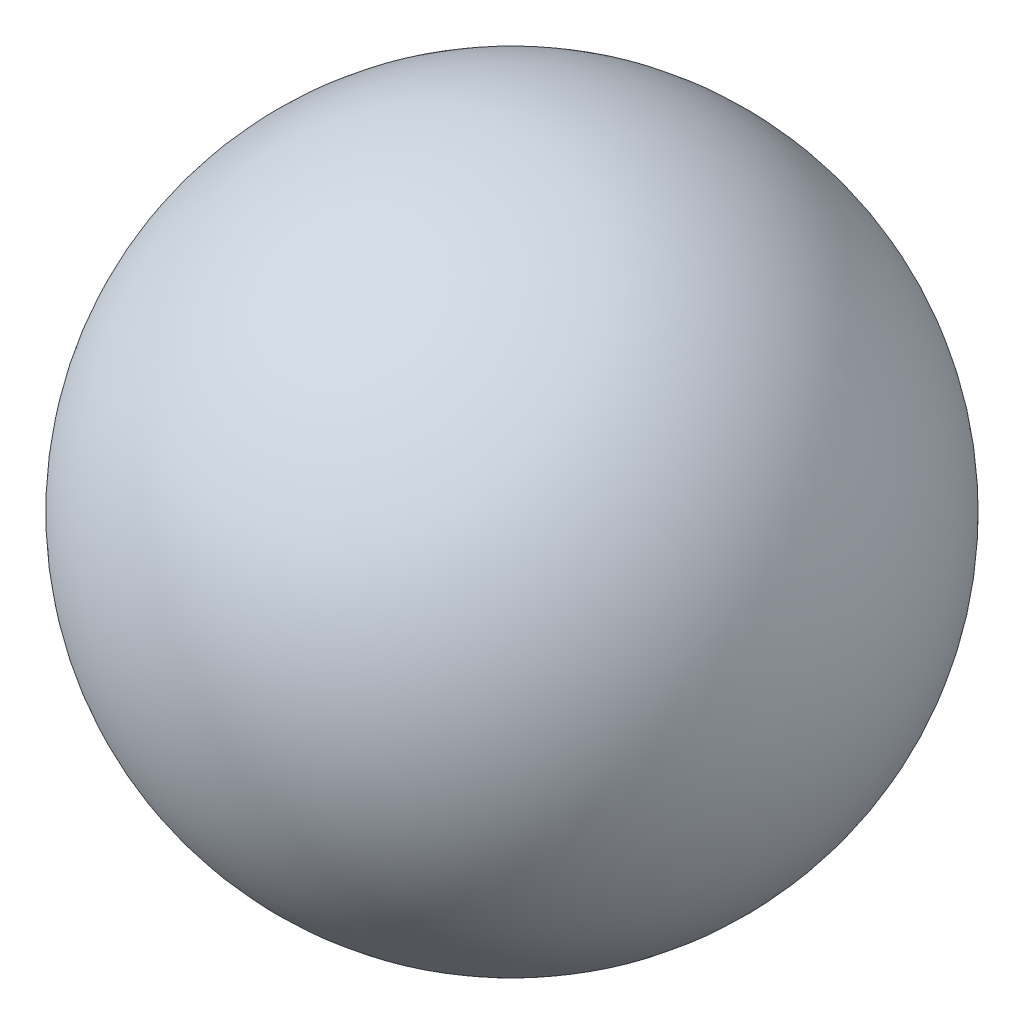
from build123d import *


with BuildPart() as part:
    # Sketch1 → Revolve1 (revolve)
    with BuildSketch(Plane(origin=(0, 0, 0), x_dir=(0, 0, -1), z_dir=(1, 0, 0))):
        with BuildLine():
            Line((0, 3.175), (0, -3.175))
            ThreePointArc((0, -3.175), (3.175, 0), (0, 3.175))
        make_face()
    revolve(axis=Axis((0, 7.936214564, 0), (0, -1, 0)))


solid = part.part
